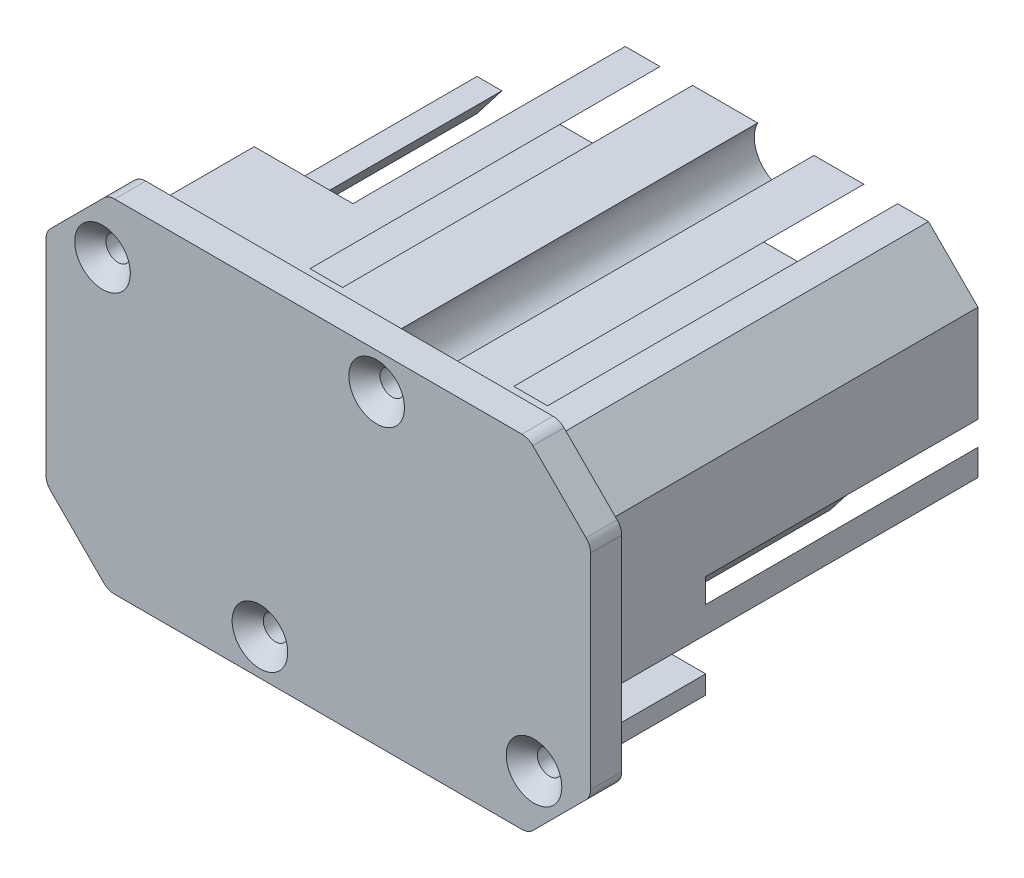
from build123d import *

# Parameters (mm, degrees)
SKETCH1_W           = 70
SKETCH1_H           = 44
SKETCH1_R           = 1.575
BOSS_EXTRUDE1_DEPTH = 4
CHAMFER1_SIZE       = 8
BOSS_EXTRUDE2_DEPTH = 3.6
FILLET1_R           = 2
CHAMFER2_SIZE       = 2
BOSS_EXTRUDE3_DEPTH = 10
BOSS_EXTRUDE4_DEPTH = 35
CUT_EXTRUDE1_START  = -48.6
CUT_EXTRUDE1_DEPTH  = 48.6


with BuildPart() as part:
    # Sketch1 → Boss-Extrude1 (new body)
    with BuildSketch(Plane.XY):
        Rectangle(SKETCH1_W, SKETCH1_H)
        with Locations((-27.729631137, 14.729631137)):
            Circle(SKETCH1_R, mode=Mode.SUBTRACT)
        with Locations((7.5, 17.375)):
            Circle(SKETCH1_R, mode=Mode.SUBTRACT)
        with Locations((27.729631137, -14.729631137)):
            Circle(SKETCH1_R, mode=Mode.SUBTRACT)
        with Locations((-7.5, -17.375)):
            Circle(SKETCH1_R, mode=Mode.SUBTRACT)
    extrude(amount=BOSS_EXTRUDE1_DEPTH)

    # Chamfer1
    chamfer1_edges = [part.edges().sort_by_distance(p)[0] for p in [
        (-35, 22, 2),
        (35, 22, 2),
        (35, -22, 2),
        (-35, -22, 2),
    ]]
    chamfer(chamfer1_edges, length=CHAMFER1_SIZE)

    # Sketch3 → Boss-Extrude2 (add)
    with BuildSketch(Plane(origin=(0, 0, 0), x_dir=(-1, 0, 0), z_dir=(0, 0, -1))):
        with BuildLine():
            Line((-25.840202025, 19.2), (-32.2, 12.840202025))
            Line((-32.2, 12.840202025), (-32.2, -6.116575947))
            Line((-32.2, -6.116575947), (-13.460488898, -6.116575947))
            Line((-13.460488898, -6.116575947), (-13.460488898, -1.25989941))
            Line((-13.460488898, -1.25989941), (-16.412136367, 1.822746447))
            Line((-16.412136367, 1.822746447), (-25.840202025, 1.822746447))
            Line((-25.840202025, 1.822746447), (-25.840202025, 15.148346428))
            Line((-25.840202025, 15.148346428), (-12.950276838, 15.148346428))
            Line((-12.950276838, 15.148346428), (-12.950276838, 10.843762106))
            Line((-12.950276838, 10.843762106), (0.579404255, 10.843762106))
            Line((0.579404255, 10.843762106), (0.579404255, 15.148346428))
            Line((0.579404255, 15.148346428), (13.49192193, 15.148346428))
            Line((13.49192193, 15.148346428), (13.49192193, 10.843762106))
            Line((13.49192193, 10.843762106), (20.193996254, 10.843762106))
            Line((20.193996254, 10.843762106), (32.2, 9.862970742))
            Line((32.2, 9.862970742), (32.2, 12.840202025))
            Line((32.2, 12.840202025), (31.576648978, 13.463553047))
            ThreePointArc((31.576648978, 13.463553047), (24.865848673, 11.865848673), (26.463553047, 18.576648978))
            Line((26.463553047, 18.576648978), (25.840202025, 19.2))
            Line((25.840202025, 19.2), (-3.884495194, 19.2))
            ThreePointArc((-3.884495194, 19.2), (-7.5, 13.325), (-11.115504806, 19.2))
            Line((-11.115504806, 19.2), (-25.840202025, 19.2))
        make_face()
        with BuildLine():
            Line((-13.460488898, -10.468662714), (-32.2, -10.468662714))
            Line((-32.2, -10.468662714), (-32.2, -12.840202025))
            Line((-32.2, -12.840202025), (-31.576648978, -13.463553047))
            ThreePointArc((-31.576648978, -13.463553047), (-24.865848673, -11.865848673), (-26.463553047, -18.576648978))
            Line((-26.463553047, -18.576648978), (-25.840202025, -19.2))
            Line((-25.840202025, -19.2), (3.884495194, -19.2))
            ThreePointArc((3.884495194, -19.2), (7.5, -13.325), (11.115504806, -19.2))
            Line((11.115504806, -19.2), (25.840202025, -19.2))
            Line((25.840202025, -19.2), (32.2, -12.840202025))
            Line((32.2, -12.840202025), (32.2, 6.336498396))
            Line((32.2, 6.336498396), (14.120660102, 6.336498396))
            Line((14.120660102, 6.336498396), (14.120660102, 1.822746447))
            Line((14.120660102, 1.822746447), (17.644822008, -1.701415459))
            Line((17.644822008, -1.701415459), (27.04741326, -1.701415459))
            Line((27.04741326, -1.701415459), (27.04741326, -15.136118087))
            Line((27.04741326, -15.136118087), (13.093547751, -15.136118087))
            Line((13.093547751, -15.136118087), (13.093547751, -10.468662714))
            Line((13.093547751, -10.468662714), (0, -10.468662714))
            Line((0, -10.468662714), (0, -15.136118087))
            Line((0, -15.136118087), (-13.460488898, -15.136118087))
            Line((-13.460488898, -15.136118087), (-13.460488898, -10.468662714))
        make_face()
        Polygon((9.348169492, 1.822746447), (13.49192193, -1.701415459), (13.093547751, -5.73813362), (0, -5.73813362), (0, -1.25989941), (-9.159798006, -1.25989941), (-12.684082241, 1.822746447), (-12.684082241, 6.336498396), (0.579404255, 6.336498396), (0.579404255, 1.822746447), align=None)
    extrude(amount=BOSS_EXTRUDE2_DEPTH)

    # Fillet1
    fillet1_edges = [part.edges().sort_by_distance(p)[0] for p in [
        (-27, 22, 2),
        (27, 22, 2),
        (35, -14, 2),
        (35, 14, 2),
        (-35, -14, 2),
        (-35, 14, 2),
        (-27, -22, 2),
        (27, -22, 2),
    ]]
    fillet(fillet1_edges, radius=FILLET1_R)

    # Chamfer2
    chamfer2_edges = [part.edges().sort_by_distance(p)[0] for p in [
        (-29.304631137, 14.729631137, 4),
        (5.925, 17.375, 4),
        (26.154631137, -14.729631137, 4),
        (-9.075, -17.375, 4),
    ]]
    chamfer(chamfer2_edges, length=CHAMFER2_SIZE)

    # Sketch5 → Boss-Extrude3 (add)
    with BuildSketch(Plane(origin=(0, 0, -3.6), x_dir=(-1, 0, 0), z_dir=(0, 0, -1))):
        with BuildLine():
            ThreePointArc((9.160284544, -5.73813362), (10.302966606, -3.054018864), (12.121227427, -0.772764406))
            ThreePointArc((12.121227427, -0.772764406), (6.542073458, -2.295938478), (0.972961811, -0.736446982))
            ThreePointArc((0.972961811, -0.736446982), (2.819895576, -3.030847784), (3.980086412, -5.73813362))
            Line((3.980086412, -5.73813362), (9.160284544, -5.73813362))
        make_face()
        with BuildLine():
            Line((14.644763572, 1.298642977), (14.826972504, 1.116434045))
            ThreePointArc((14.826972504, 1.116434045), (29.838093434, -5.110254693), (21.739668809, -19.2))
            Line((21.739668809, -19.2), (25.840202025, -19.2))
            Line((25.840202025, -19.2), (32.2, -12.840202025))
            Line((32.2, -12.840202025), (32.2, 6.336498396))
            Line((32.2, 6.336498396), (17.198375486, 6.336498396))
            ThreePointArc((17.198375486, 6.336498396), (16.255132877, 3.648492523), (14.644763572, 1.298642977))
        make_face()
        with BuildLine():
            ThreePointArc((17.451290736, -19.2), (11.848261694, -16.147631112), (8.939617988, -10.468662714))
            Line((8.939617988, -10.468662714), (4.206941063, -10.468662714))
            ThreePointArc((4.206941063, -10.468662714), (1.335650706, -16.123537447), (-4.210275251, -19.2))
            Line((-4.210275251, -19.2), (3.884495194, -19.2))
            ThreePointArc((3.884495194, -19.2), (7.5, -13.325), (11.115504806, -19.2))
            Line((11.115504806, -19.2), (17.451290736, -19.2))
        make_face()
        with BuildLine():
            ThreePointArc((-11.631169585, 0.901777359), (-6.218010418, 2.21451513), (-0.868601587, 0.662291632))
            ThreePointArc((-0.868601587, 0.662291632), (-2.891111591, 3.255972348), (-4.043537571, 6.336498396))
            Line((-4.043537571, 6.336498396), (-9.097612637, 6.336498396))
            ThreePointArc((-9.097612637, 6.336498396), (-10.114441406, 3.526930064), (-11.859964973, 1.101901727))
            Line((-11.859964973, 1.101901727), (-11.631169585, 0.901777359))
        make_face()
        with BuildLine():
            Line((-9.100253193, 10.843762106), (-4.028184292, 10.843762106))
            ThreePointArc((-4.028184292, 10.843762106), (-1.023607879, 16.296478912), (4.483584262, 19.2))
            Line((4.483584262, 19.2), (-3.884495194, 19.2))
            ThreePointArc((-3.884495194, 19.2), (-7.5, 13.325), (-11.115504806, 19.2))
            Line((-11.115504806, 19.2), (-17.528515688, 19.2))
            ThreePointArc((-17.528515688, 19.2), (-12.068524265, 16.278479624), (-9.100253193, 10.843762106))
        make_face()
        with BuildLine():
            ThreePointArc((-16.994595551, -6.116575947), (-15.84953636, -3.22137215), (-13.927900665, -0.771743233))
            Line((-13.927900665, -0.771743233), (-14.038433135, -0.656305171))
            ThreePointArc((-14.038433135, -0.656305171), (-29.777674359, 4.610070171), (-21.866140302, 19.2))
            Line((-21.866140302, 19.2), (-25.840202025, 19.2))
            Line((-25.840202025, 19.2), (-32.2, 12.840202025))
            Line((-32.2, 12.840202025), (-32.2, -6.116575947))
            Line((-32.2, -6.116575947), (-16.994595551, -6.116575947))
        make_face()
        with BuildLine():
            ThreePointArc((8.671253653, 19.2), (14.178445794, 16.296478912), (17.183022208, 10.843762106))
            Line((17.183022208, 10.843762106), (20.193996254, 10.843762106))
            Line((20.193996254, 10.843762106), (32.2, 9.862970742))
            Line((32.2, 9.862970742), (32.2, 12.840202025))
            Line((32.2, 12.840202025), (31.576648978, 13.463553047))
            ThreePointArc((31.576648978, 13.463553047), (24.865848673, 11.865848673), (26.463553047, 18.576648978))
            Line((26.463553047, 18.576648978), (25.840202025, 19.2))
            Line((25.840202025, 19.2), (8.671253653, 19.2))
        make_face()
        with BuildLine():
            Line((-25.840202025, -19.2), (-8.707449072, -19.2))
            ThreePointArc((-8.707449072, -19.2), (-14.253375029, -16.123537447), (-17.124665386, -10.468662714))
            Line((-17.124665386, -10.468662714), (-32.2, -10.468662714))
            Line((-32.2, -10.468662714), (-32.2, -12.840202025))
            Line((-32.2, -12.840202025), (-31.576648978, -13.463553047))
            ThreePointArc((-31.576648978, -13.463553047), (-24.865848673, -11.865848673), (-26.463553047, -18.576648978))
            Line((-26.463553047, -18.576648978), (-25.840202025, -19.2))
        make_face()
    extrude(amount=BOSS_EXTRUDE3_DEPTH)

    # Sketch6 → Boss-Extrude4 (add)
    with BuildSketch(Plane(origin=(0, 0, -13.6), x_dir=(-1, 0, 0), z_dir=(0, 0, -1))):
        with BuildLine():
            ThreePointArc((14.826972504, 1.116434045), (29.838093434, -5.110254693), (21.739668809, -19.2))
            Line((21.739668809, -19.2), (25.840202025, -19.2))
            Line((25.840202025, -19.2), (32.2, -12.840202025))
            Line((32.2, -12.840202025), (32.2, -5.044340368))
            Line((32.2, -5.044340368), (23.112299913, 6.336498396))
            Line((23.112299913, 6.336498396), (17.198375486, 6.336498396))
            ThreePointArc((17.198375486, 6.336498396), (16.255132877, 3.648492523), (14.644763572, 1.298642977))
            Line((14.644763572, 1.298642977), (14.826972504, 1.116434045))
        make_face()
        Polygon((29.000684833, 6.336498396), (32.2, 2.192713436), (32.2, 6.336498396), align=None)
        with BuildLine():
            Line((19.603886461, 10.843762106), (13.145894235, 19.2))
            Line((13.145894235, 19.2), (8.671253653, 19.2))
            ThreePointArc((8.671253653, 19.2), (14.178445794, 16.296478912), (17.183022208, 10.843762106))
            Line((17.183022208, 10.843762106), (19.603886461, 10.843762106))
        make_face()
        Polygon((-32.2, -6.116575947), (-29.440061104, -6.116575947), (-32.2, -2.74495353), align=None)
        with BuildLine():
            Line((-19.999194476, -10.468662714), (-13.221204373, -19.2))
            Line((-13.221204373, -19.2), (-8.707449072, -19.2))
            ThreePointArc((-8.707449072, -19.2), (-14.253375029, -16.123537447), (-17.124665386, -10.468662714))
            Line((-17.124665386, -10.468662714), (-19.999194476, -10.468662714))
        make_face()
        with BuildLine():
            Line((-29.610356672, 2.069250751), (-23.213727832, -6.116575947))
            Line((-23.213727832, -6.116575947), (-16.994595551, -6.116575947))
            ThreePointArc((-16.994595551, -6.116575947), (-15.84953636, -3.22137215), (-13.927900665, -0.771743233))
            Line((-13.927900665, -0.771743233), (-14.038433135, -0.656305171))
            ThreePointArc((-14.038433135, -0.656305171), (-29.777674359, 4.610070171), (-21.866140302, 19.2))
            Line((-21.866140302, 19.2), (-25.840202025, 19.2))
            Line((-25.840202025, 19.2), (-32.2, 12.840202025))
            Line((-32.2, 12.840202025), (-32.2, 0.367382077))
            Line((-32.2, 0.367382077), (-29.610356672, 2.069250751))
        make_face()
        with BuildLine():
            ThreePointArc((-17.528515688, 19.2), (-12.068524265, 16.278479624), (-9.100253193, 10.843762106))
            Line((-9.100253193, 10.843762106), (-4.028184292, 10.843762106))
            ThreePointArc((-4.028184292, 10.843762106), (-1.023607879, 16.296478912), (4.483584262, 19.2))
            Line((4.483584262, 19.2), (-3.884495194, 19.2))
            ThreePointArc((-3.884495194, 19.2), (-7.5, 13.325), (-11.115504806, 19.2))
            Line((-11.115504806, 19.2), (-17.528515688, 19.2))
        make_face()
        with BuildLine():
            ThreePointArc((-9.097612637, 6.336498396), (-10.114441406, 3.526930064), (-11.859964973, 1.101901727))
            Line((-11.859964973, 1.101901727), (-11.631169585, 0.901777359))
            ThreePointArc((-11.631169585, 0.901777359), (-6.218010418, 2.21451513), (-0.868601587, 0.662291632))
            ThreePointArc((-0.868601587, 0.662291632), (-2.891111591, 3.255972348), (-4.043537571, 6.336498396))
            Line((-4.043537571, 6.336498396), (-9.097612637, 6.336498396))
        make_face()
        with BuildLine():
            ThreePointArc((0.972961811, -0.736446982), (2.819895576, -3.030847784), (3.980086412, -5.73813362))
            Line((3.980086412, -5.73813362), (9.160284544, -5.73813362))
            ThreePointArc((9.160284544, -5.73813362), (10.302966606, -3.054018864), (12.121227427, -0.772764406))
            ThreePointArc((12.121227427, -0.772764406), (6.542073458, -2.295938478), (0.972961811, -0.736446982))
        make_face()
        with BuildLine():
            ThreePointArc((4.206941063, -10.468662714), (1.335650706, -16.123537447), (-4.210275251, -19.2))
            Line((-4.210275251, -19.2), (3.884495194, -19.2))
            ThreePointArc((3.884495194, -19.2), (7.5, -13.325), (11.115504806, -19.2))
            Line((11.115504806, -19.2), (17.451290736, -19.2))
            ThreePointArc((17.451290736, -19.2), (11.848261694, -16.147631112), (8.939617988, -10.468662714))
            Line((8.939617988, -10.468662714), (4.206941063, -10.468662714))
        make_face()
    extrude(amount=BOSS_EXTRUDE4_DEPTH)

    # Sketch7 → Cut-Extrude1 (cut)
    with BuildSketch(Plane(origin=(0, 0, -48.6), x_dir=(-1, 0, 0), z_dir=(0, 0, -1)).offset(CUT_EXTRUDE1_START)):
        Polygon((24.470026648, 7.878289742), (18.990478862, -4.241180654), (22.831105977, -5.977634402), (29.320216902, 8.374752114), align=None)
    extrude(amount=CUT_EXTRUDE1_DEPTH, mode=Mode.SUBTRACT)


solid = part.part
